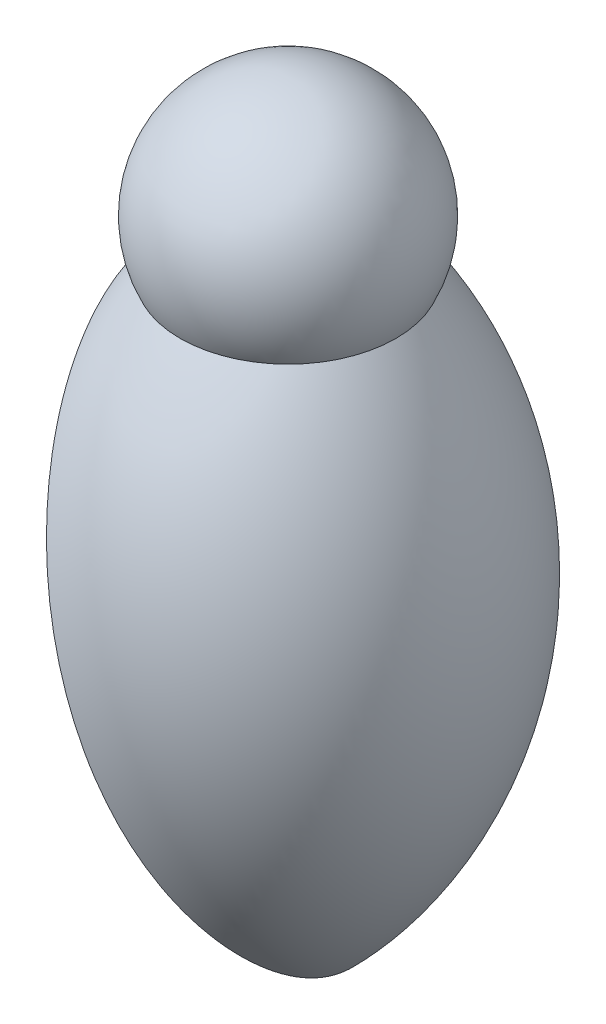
from build123d import *


with BuildPart() as part:
    # Skica1 → Oto_it kolem osy1 (revolve)
    with BuildSketch(Plane.XY):
        with BuildLine():
            Line((0, 0), (0, 189.75))
            ThreePointArc((0, 189.75), (24.360344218, 176.268795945), (25.875, 148.468165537))
            ThreePointArc((25.875, 148.468165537), (44.444366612, 68.743072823), (0, 0))
        make_face()
    revolve(axis=Axis((0, 0, 0), (0, 1, 0)))

    # Odebrat povrchem1
    split(bisect_by=Plane(origin=(17.814666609, 6.239469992, 0), x_dir=(0, 0, 1), z_dir=(-0.9437866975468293, -0.33055509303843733, 0)), keep=Keep.BOTTOM)


solid = part.part
